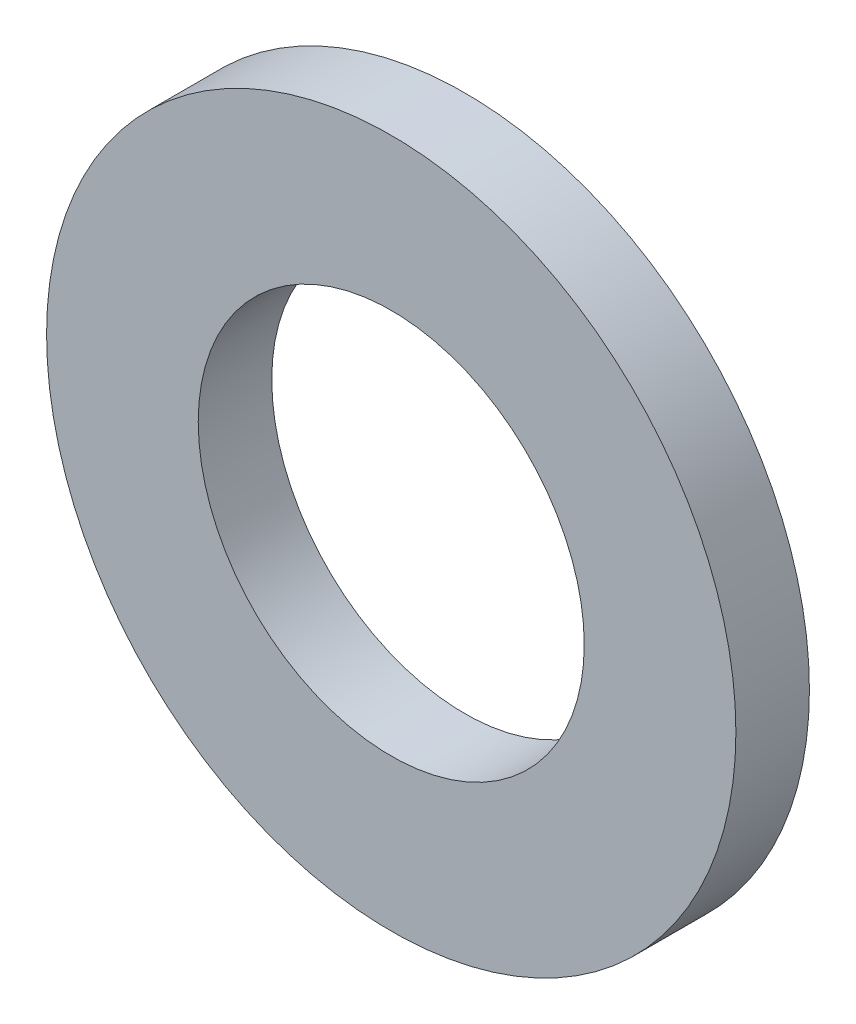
from build123d import *

# Parameters (mm, degrees)
SKETCH_1_R      = 7.5
SKETCH_1_R_2    = 4.2
EXTRUDE_1_DEPTH = 1.6


with BuildPart() as part:
    # Sketch 1 → Extrude 1 (new body)
    with BuildSketch(Plane.XY):
        Circle(SKETCH_1_R)
        Circle(SKETCH_1_R_2, mode=Mode.SUBTRACT)
    extrude(amount=EXTRUDE_1_DEPTH)


solid = part.part
